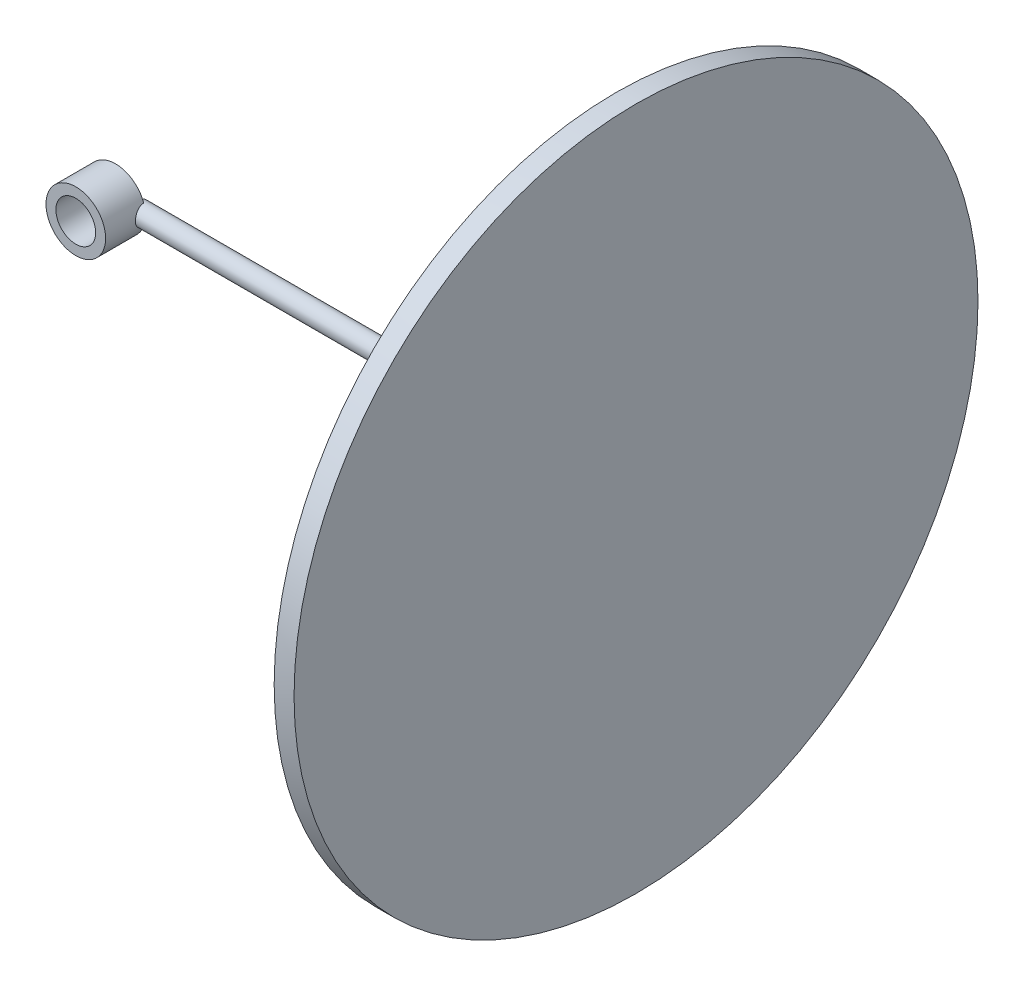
ISO-10303-21;
HEADER;
FILE_DESCRIPTION(('STEP AP214'),'2;1');
FILE_NAME('part.step','',(''),(''),'','','');
FILE_SCHEMA(('AUTOMOTIVE_DESIGN { 1 0 10303 214 1 1 1 1 }'));
ENDSEC;
DATA;
#1=APPLICATION_CONTEXT('core data for automotive mechanical design processes');
#2=APPLICATION_PROTOCOL_DEFINITION('international standard','automotive_design',2000,#1);
#3=PRODUCT_CONTEXT('',#1,'mechanical');
#4=PRODUCT('Part','Part','',(#3));
#5=PRODUCT_RELATED_PRODUCT_CATEGORY('part','',(#4));
#6=PRODUCT_DEFINITION_FORMATION('','',#4);
#7=PRODUCT_DEFINITION_CONTEXT('part definition',#1,'design');
#8=PRODUCT_DEFINITION('design','',#6,#7);
#9=PRODUCT_DEFINITION_SHAPE('','',#8);
#10=(LENGTH_UNIT() NAMED_UNIT(*) SI_UNIT(.MILLI.,.METRE.));
#11=(NAMED_UNIT(*) PLANE_ANGLE_UNIT() SI_UNIT($,.RADIAN.));
#12=(NAMED_UNIT(*) SI_UNIT($,.STERADIAN.) SOLID_ANGLE_UNIT());
#13=UNCERTAINTY_MEASURE_WITH_UNIT(LENGTH_MEASURE(1.E-05),#10,'distance_accuracy_value','');
#14=(GEOMETRIC_REPRESENTATION_CONTEXT(3) GLOBAL_UNCERTAINTY_ASSIGNED_CONTEXT((#13)) GLOBAL_UNIT_ASSIGNED_CONTEXT((#10,
#11,#12)) REPRESENTATION_CONTEXT('',''));
#15=CARTESIAN_POINT('',(0.,0.,0.));
#16=DIRECTION('',(0.,0.,1.));
#17=DIRECTION('',(1.,0.,0.));
#18=AXIS2_PLACEMENT_3D('',#15,#16,#17);
#19=CARTESIAN_POINT('',(-73.8428088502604,4.70438828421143,0.));
#20=DIRECTION('',(1.,0.,0.));
#21=DIRECTION('',(0.,1.,0.));
#22=AXIS2_PLACEMENT_3D('',#19,#20,#21);
#23=CYLINDRICAL_SURFACE('',#22,2.5);
#24=CARTESIAN_POINT('',(-88.2758739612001,4.70438828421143,0.));
#25=DIRECTION('',(1.,0.,0.));
#26=DIRECTION('',(0.,1.,0.));
#27=AXIS2_PLACEMENT_3D('',#24,#25,#26);
#28=CIRCLE('',#27,2.49999999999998);
#29=CARTESIAN_POINT('',(-88.2758739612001,7.20438828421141,0.));
#30=VERTEX_POINT('',#29);
#31=EDGE_CURVE('E90',#30,#30,#28,.T.);
#32=ORIENTED_EDGE('',*,*,#31,.F.);
#33=EDGE_LOOP('',(#32));
#34=FACE_BOUND('',#33,.T.);
#35=CARTESIAN_POINT('',(-207.08903190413,7.20438828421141,0.));
#36=CARTESIAN_POINT('',(-207.089042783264,7.20439727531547,0.0682070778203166));
#37=CARTESIAN_POINT('',(-207.08804527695,7.20159715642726,0.13640807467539));
#38=CARTESIAN_POINT('',(-207.084114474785,7.19044874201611,0.272281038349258));
#39=CARTESIAN_POINT('',(-207.081181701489,7.18210194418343,0.339953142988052));
#40=CARTESIAN_POINT('',(-207.07347266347,7.15996287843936,0.47409048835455));
#41=CARTESIAN_POINT('',(-207.068701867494,7.14618676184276,0.540558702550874));
#42=CARTESIAN_POINT('',(-207.057473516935,7.11333009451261,0.672008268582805));
#43=CARTESIAN_POINT('',(-207.051015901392,7.09424935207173,0.736989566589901));
#44=CARTESIAN_POINT('',(-207.029400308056,7.02930379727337,0.928961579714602));
#45=CARTESIAN_POINT('',(-207.011987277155,6.97570245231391,1.05317915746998));
#46=CARTESIAN_POINT('',(-206.97312937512,6.84956612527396,1.29087681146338));
#47=CARTESIAN_POINT('',(-206.951682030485,6.77701951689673,1.40435023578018));
#48=CARTESIAN_POINT('',(-206.906237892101,6.6120182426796,1.62179290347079));
#49=CARTESIAN_POINT('',(-206.882177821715,6.51895113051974,1.7252851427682));
#50=CARTESIAN_POINT('',(-206.834753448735,6.31685899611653,1.9155171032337));
#51=CARTESIAN_POINT('',(-206.81138927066,6.20783113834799,2.002253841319));
#52=CARTESIAN_POINT('',(-206.767252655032,5.97339750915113,2.15869822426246));
#53=CARTESIAN_POINT('',(-206.746563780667,5.84763853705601,2.22790230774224));
#54=CARTESIAN_POINT('',(-206.710859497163,5.58546137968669,2.3439807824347));
#55=CARTESIAN_POINT('',(-206.695842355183,5.44904646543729,2.39086199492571));
#56=CARTESIAN_POINT('',(-206.673622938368,5.17446165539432,2.45933927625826));
#57=CARTESIAN_POINT('',(-206.666166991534,5.03651787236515,2.48175817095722));
#58=CARTESIAN_POINT('',(-206.659009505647,4.75863570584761,2.50329075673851));
#59=CARTESIAN_POINT('',(-206.659306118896,4.61869780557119,2.50241000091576));
#60=CARTESIAN_POINT('',(-206.667448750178,4.34662867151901,2.4778892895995));
#61=CARTESIAN_POINT('',(-206.674998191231,4.21440652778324,2.45514340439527));
#62=CARTESIAN_POINT('',(-206.696425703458,3.9557781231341,2.3890170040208));
#63=CARTESIAN_POINT('',(-206.710304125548,3.82937218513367,2.34563534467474));
#64=CARTESIAN_POINT('',(-206.743208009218,3.58400672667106,2.23894657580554));
#65=CARTESIAN_POINT('',(-206.762298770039,3.46516702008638,2.17538488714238));
#66=CARTESIAN_POINT('',(-206.803640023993,3.23957681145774,2.03035012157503));
#67=CARTESIAN_POINT('',(-206.825891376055,3.13282960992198,1.94887217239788));
#68=CARTESIAN_POINT('',(-206.872442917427,2.92914493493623,1.76582237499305));
#69=CARTESIAN_POINT('',(-206.896790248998,2.83290425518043,1.66348614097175));
#70=CARTESIAN_POINT('',(-206.943912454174,2.65870822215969,1.44389627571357));
#71=CARTESIAN_POINT('',(-206.966686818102,2.58075877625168,1.32663784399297));
#72=CARTESIAN_POINT('',(-207.008348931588,2.44437997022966,1.07829955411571));
#73=CARTESIAN_POINT('',(-207.02717434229,2.38625576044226,0.947041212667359));
#74=CARTESIAN_POINT('',(-207.058072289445,2.29323770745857,0.675882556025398));
#75=CARTESIAN_POINT('',(-207.070155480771,2.25830719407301,0.535996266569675));
#76=CARTESIAN_POINT('',(-207.081686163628,2.22524289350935,0.328953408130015));
#77=CARTESIAN_POINT('',(-207.08443302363,2.21742563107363,0.263396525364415));
#78=CARTESIAN_POINT('',(-207.088107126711,2.20700174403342,0.131904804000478));
#79=CARTESIAN_POINT('',(-207.089036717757,2.20438839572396,0.0659705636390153));
#80=CARTESIAN_POINT('',(-207.08903190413,2.20438828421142,0.));
#81=B_SPLINE_CURVE_WITH_KNOTS('',3,(#35,#36,#37,#38,#39,#40,#41,#42,#43,#44,#45,#46,#47,#48,#49,
#50,#51,#52,#53,#54,#55,#56,#57,#58,#59,#60,#61,#62,#63,#64,#65,#66,#67,#68,#69,#70,#71,#72,#73,
#74,#75,#76,#77,#78,#79,#80),.UNSPECIFIED.,.F.,.F.,(4,2,2,2,2,2,2,2,2,2,2,2,2,2,2,2,2,2,2,2,2,2,
4),(0.,0.204546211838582,0.409037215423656,0.612924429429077,0.816819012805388,1.22401016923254,
1.63145179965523,2.0532786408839,2.47518051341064,2.90809434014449,3.34087579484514,
3.75860278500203,4.17623021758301,4.57747647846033,4.97874498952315,5.38529148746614,
5.79194868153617,6.21771736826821,6.64362337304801,7.07581676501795,7.50732520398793,
7.70536340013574,7.90314555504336),.UNSPECIFIED.);
#82=CARTESIAN_POINT('',(-207.08903190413,7.20438828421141,0.));
#83=VERTEX_POINT('',#82);
#84=CARTESIAN_POINT('',(-207.08903190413,2.20438828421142,0.));
#85=VERTEX_POINT('',#84);
#86=EDGE_CURVE('E11',#83,#85,#81,.T.);
#87=ORIENTED_EDGE('',*,*,#86,.T.);
#88=DIRECTION('',(1.,0.,0.));
#89=VECTOR('',#88,1.);
#90=CARTESIAN_POINT('',(-73.8428088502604,2.20438828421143,0.));
#91=LINE('',#90,#89);
#92=CARTESIAN_POINT('',(-208.2758739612,2.2043882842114,0.));
#93=VERTEX_POINT('',#92);
#94=EDGE_CURVE('E74',#85,#93,#91,.F.);
#95=ORIENTED_EDGE('',*,*,#94,.T.);
#96=CARTESIAN_POINT('',(-208.2758739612,4.70438828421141,0.));
#97=DIRECTION('',(1.,0.,0.));
#98=DIRECTION('',(0.,1.,0.));
#99=AXIS2_PLACEMENT_3D('',#96,#97,#98);
#100=CIRCLE('',#99,2.50000000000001);
#101=CARTESIAN_POINT('',(-208.2758739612,7.20438828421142,0.));
#102=VERTEX_POINT('',#101);
#103=EDGE_CURVE('E80',#93,#102,#100,.T.);
#104=ORIENTED_EDGE('',*,*,#103,.T.);
#105=DIRECTION('',(1.,0.,0.));
#106=VECTOR('',#105,1.);
#107=CARTESIAN_POINT('',(-73.8428088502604,7.20438828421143,0.));
#108=LINE('',#107,#106);
#109=EDGE_CURVE('E57',#102,#83,#108,.T.);
#110=ORIENTED_EDGE('',*,*,#109,.T.);
#111=EDGE_LOOP('',(#87,#95,#104,#110));
#112=FACE_BOUND('',#111,.T.);
#113=ADVANCED_FACE('F37',(#34,#112),#23,.T.);
#114=CARTESIAN_POINT('',(-208.2758739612,7.20438828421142,0.));
#115=DIRECTION('',(-1.,0.,0.));
#116=DIRECTION('',(0.,-1.,0.));
#117=AXIS2_PLACEMENT_3D('',#114,#115,#116);
#118=PLANE('',#117);
#119=ORIENTED_EDGE('',*,*,#103,.F.);
#120=DIRECTION('',(0.,1.,0.));
#121=VECTOR('',#120,1.);
#122=CARTESIAN_POINT('',(-208.2758739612,7.20438828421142,0.));
#123=LINE('',#122,#121);
#124=EDGE_CURVE('E50',#93,#102,#123,.T.);
#125=ORIENTED_EDGE('',*,*,#124,.T.);
#126=EDGE_LOOP('',(#119,#125));
#127=FACE_BOUND('',#126,.T.);
#128=ADVANCED_FACE('F96',(#127),#118,.T.);
#129=CARTESIAN_POINT('',(-85.7758739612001,4.70438828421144,0.));
#130=DIRECTION('',(1.,0.,0.));
#131=DIRECTION('',(0.,1.,0.));
#132=AXIS2_PLACEMENT_3D('',#129,#130,#131);
#133=SPHERICAL_SURFACE('',#132,86.036329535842);
#134=CARTESIAN_POINT('',(-88.2758739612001,4.70438828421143,0.));
#135=DIRECTION('',(1.,0.,0.));
#136=DIRECTION('',(0.,1.,0.));
#137=AXIS2_PLACEMENT_3D('',#134,#135,#136);
#138=CIRCLE('',#137,86.);
#139=CARTESIAN_POINT('',(-88.2758739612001,90.7043882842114,0.));
#140=VERTEX_POINT('',#139);
#141=EDGE_CURVE('E93',#140,#140,#138,.T.);
#142=CARTESIAN_POINT('',(-83.2758739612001,4.70438828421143,0.));
#143=DIRECTION('',(1.,0.,0.));
#144=DIRECTION('',(0.,1.,0.));
#145=AXIS2_PLACEMENT_3D('',#142,#143,#144);
#146=CIRCLE('',#145,86.);
#147=CARTESIAN_POINT('',(-83.2758739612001,90.7043882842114,0.));
#148=VERTEX_POINT('',#147);
#149=EDGE_CURVE('E82',#148,#148,#146,.T.);
#150=CARTESIAN_POINT('',(-88.2758739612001,90.7043882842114,0.));
#151=CARTESIAN_POINT('',(-88.223805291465,90.7059019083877,0.));
#152=CARTESIAN_POINT('',(-88.1717352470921,90.7073682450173,0.));
#153=CARTESIAN_POINT('',(-88.0675925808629,90.7102063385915,0.));
#154=CARTESIAN_POINT('',(-88.0155199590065,90.7115780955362,0.));
#155=CARTESIAN_POINT('',(-87.9113723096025,90.714227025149,0.));
#156=CARTESIAN_POINT('',(-87.8592972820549,90.7155041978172,0.));
#157=CARTESIAN_POINT('',(-87.7551449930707,90.7179639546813,0.));
#158=CARTESIAN_POINT('',(-87.7030677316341,90.7191465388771,0.));
#159=CARTESIAN_POINT('',(-87.5989111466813,90.7214171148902,0.));
#160=CARTESIAN_POINT('',(-87.546831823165,90.7225051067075,0.));
#161=CARTESIAN_POINT('',(-87.4426712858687,90.7245864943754,0.));
#162=CARTESIAN_POINT('',(-87.3905900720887,90.7255798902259,0.));
#163=CARTESIAN_POINT('',(-87.2864259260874,90.7274720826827,0.));
#164=CARTESIAN_POINT('',(-87.2343429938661,90.7283708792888,0.));
#165=CARTESIAN_POINT('',(-87.13017558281,90.7300738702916,0.));
#166=CARTESIAN_POINT('',(-87.0780911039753,90.7308780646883,0.));
#167=CARTESIAN_POINT('',(-86.9739207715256,90.7323918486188,0.));
#168=CARTESIAN_POINT('',(-86.9218349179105,90.7331014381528,0.));
#169=CARTESIAN_POINT('',(-86.8176620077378,90.7344260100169,0.));
#170=CARTESIAN_POINT('',(-86.7655749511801,90.7350409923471,0.));
#171=CARTESIAN_POINT('',(-86.6613998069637,90.7361763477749,0.));
#172=CARTESIAN_POINT('',(-86.6093117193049,90.7366967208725,0.));
#173=CARTESIAN_POINT('',(-86.5051346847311,90.7376428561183,0.));
#174=CARTESIAN_POINT('',(-86.4530457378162,90.7380686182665,0.));
#175=CARTESIAN_POINT('',(-86.3488671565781,90.7388255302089,0.));
#176=CARTESIAN_POINT('',(-86.2967775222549,90.739156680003,0.));
#177=CARTESIAN_POINT('',(-86.1925977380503,90.7397243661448,0.));
#178=CARTESIAN_POINT('',(-86.1405075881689,90.7399609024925,0.));
#179=CARTESIAN_POINT('',(-86.0363269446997,90.7403393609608,0.));
#180=CARTESIAN_POINT('',(-85.9842364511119,90.7404812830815,0.));
#181=CARTESIAN_POINT('',(-85.8800552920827,90.7406705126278,0.));
#182=CARTESIAN_POINT('',(-85.8279646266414,90.7407178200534,0.));
#183=CARTESIAN_POINT('',(-85.7237832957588,90.7407178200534,0.));
#184=CARTESIAN_POINT('',(-85.6716926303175,90.7406705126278,0.));
#185=CARTESIAN_POINT('',(-85.5675114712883,90.7404812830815,0.));
#186=CARTESIAN_POINT('',(-85.5154209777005,90.7403393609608,0.));
#187=CARTESIAN_POINT('',(-85.4112403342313,90.7399609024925,0.));
#188=CARTESIAN_POINT('',(-85.3591501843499,90.7397243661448,0.));
#189=CARTESIAN_POINT('',(-85.2549704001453,90.739156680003,0.));
#190=CARTESIAN_POINT('',(-85.2028807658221,90.7388255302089,0.));
#191=CARTESIAN_POINT('',(-85.098702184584,90.7380686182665,0.));
#192=CARTESIAN_POINT('',(-85.0466132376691,90.7376428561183,0.));
#193=CARTESIAN_POINT('',(-84.9424362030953,90.7366967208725,0.));
#194=CARTESIAN_POINT('',(-84.8903481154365,90.7361763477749,0.));
#195=CARTESIAN_POINT('',(-84.7861729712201,90.7350409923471,0.));
#196=CARTESIAN_POINT('',(-84.7340859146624,90.7344260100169,0.));
#197=CARTESIAN_POINT('',(-84.6299130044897,90.7331014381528,0.));
#198=CARTESIAN_POINT('',(-84.5778271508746,90.7323918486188,0.));
#199=CARTESIAN_POINT('',(-84.4736568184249,90.7308780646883,0.));
#200=CARTESIAN_POINT('',(-84.4215723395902,90.7300738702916,0.));
#201=CARTESIAN_POINT('',(-84.3174049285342,90.7283708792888,0.));
#202=CARTESIAN_POINT('',(-84.2653219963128,90.7274720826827,0.));
#203=CARTESIAN_POINT('',(-84.1611578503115,90.7255798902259,0.));
#204=CARTESIAN_POINT('',(-84.1090766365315,90.7245864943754,0.));
#205=CARTESIAN_POINT('',(-84.0049160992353,90.7225051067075,0.));
#206=CARTESIAN_POINT('',(-83.9528367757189,90.7214171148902,0.));
#207=CARTESIAN_POINT('',(-83.8486801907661,90.7191465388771,0.));
#208=CARTESIAN_POINT('',(-83.7966029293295,90.7179639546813,0.));
#209=CARTESIAN_POINT('',(-83.6924506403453,90.7155041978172,0.));
#210=CARTESIAN_POINT('',(-83.6403756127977,90.714227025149,0.));
#211=CARTESIAN_POINT('',(-83.5362279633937,90.7115780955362,0.));
#212=CARTESIAN_POINT('',(-83.4841553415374,90.7102063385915,0.));
#213=CARTESIAN_POINT('',(-83.3800126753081,90.7073682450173,0.));
#214=CARTESIAN_POINT('',(-83.3279426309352,90.7059019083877,0.));
#215=CARTESIAN_POINT('',(-83.2758739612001,90.7043882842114,0.));
#216=B_SPLINE_CURVE_WITH_KNOTS('',3,(#150,#151,#152,#153,#154,#155,#156,#157,#158,#159,#160,
#161,#162,#163,#164,#165,#166,#167,#168,#169,#170,#171,#172,#173,#174,#175,#176,#177,#178,#179,
#180,#181,#182,#183,#184,#185,#186,#187,#188,#189,#190,#191,#192,#193,#194,#195,#196,#197,#198,
#199,#200,#201,#202,#203,#204,#205,#206,#207,#208,#209,#210,#211,#212,#213,#214,#215),
.UNSPECIFIED.,.F.,.F.,(4,2,2,2,2,2,2,2,2,2,2,2,2,2,2,2,2,2,2,2,2,2,2,2,2,2,2,2,2,2,2,2,4),(0.,
0.156271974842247,0.312543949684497,0.468815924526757,0.625087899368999,0.781359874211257,
0.937631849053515,1.09390382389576,1.25017579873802,1.40644777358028,1.56271974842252,
1.71899172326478,1.87526369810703,2.03153567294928,2.18780764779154,2.34407962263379,
2.50035159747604,2.6566235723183,2.81289554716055,2.9691675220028,3.12543949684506,
3.28171147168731,3.43798344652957,3.59425542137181,3.75052739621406,3.90679937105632,
4.06307134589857,4.21934332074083,4.37561529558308,4.53188727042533,4.68815924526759,
4.84443122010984,5.00070319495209),.UNSPECIFIED.);
#217=EDGE_CURVE('BSEAM39',#140,#148,#216,.T.);
#218=ORIENTED_EDGE('',*,*,#141,.T.);
#219=ORIENTED_EDGE('',*,*,#149,.F.);
#220=ORIENTED_EDGE('',*,*,#217,.T.);
#221=ORIENTED_EDGE('',*,*,#217,.F.);
#222=EDGE_LOOP('',(#218,#220,#219,#221));
#223=FACE_BOUND('',#222,.T.);
#224=ADVANCED_FACE('F39',(#223),#133,.T.);
#225=CARTESIAN_POINT('',(-88.2758739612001,90.7043882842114,0.));
#226=DIRECTION('',(-1.,0.,0.));
#227=DIRECTION('',(0.,-1.,0.));
#228=AXIS2_PLACEMENT_3D('',#225,#226,#227);
#229=PLANE('',#228);
#230=ORIENTED_EDGE('',*,*,#31,.T.);
#231=EDGE_LOOP('',(#230));
#232=FACE_BOUND('',#231,.T.);
#233=ORIENTED_EDGE('',*,*,#141,.F.);
#234=EDGE_LOOP('',(#233));
#235=FACE_BOUND('',#234,.T.);
#236=ADVANCED_FACE('F103',(#232,#235),#229,.T.);
#237=CARTESIAN_POINT('',(-83.2758739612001,90.7043882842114,0.));
#238=DIRECTION('',(1.,0.,0.));
#239=DIRECTION('',(0.,1.,0.));
#240=AXIS2_PLACEMENT_3D('',#237,#238,#239);
#241=PLANE('',#240);
#242=ORIENTED_EDGE('',*,*,#149,.T.);
#243=EDGE_LOOP('',(#242));
#244=FACE_BOUND('',#243,.T.);
#245=ADVANCED_FACE('F107',(#244),#241,.T.);
#246=CARTESIAN_POINT('',(-214.160099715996,4.70438828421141,10.));
#247=DIRECTION('',(0.,0.,1.));
#248=DIRECTION('',(1.,0.,0.));
#249=AXIS2_PLACEMENT_3D('',#246,#247,#248);
#250=PLANE('',#249);
#251=CARTESIAN_POINT('',(-214.160099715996,4.70438828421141,10.));
#252=DIRECTION('',(0.,0.,1.));
#253=DIRECTION('',(1.,0.,0.));
#254=AXIS2_PLACEMENT_3D('',#251,#252,#253);
#255=CIRCLE('',#254,7.50000000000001);
#256=CARTESIAN_POINT('',(-206.660099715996,4.70438828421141,10.));
#257=VERTEX_POINT('',#256);
#258=EDGE_CURVE('E75',#257,#257,#255,.T.);
#259=ORIENTED_EDGE('',*,*,#258,.T.);
#260=EDGE_LOOP('',(#259));
#261=FACE_BOUND('',#260,.T.);
#262=CARTESIAN_POINT('',(-214.160099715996,4.70438828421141,10.));
#263=DIRECTION('',(0.,0.,1.));
#264=DIRECTION('',(1.,0.,0.));
#265=AXIS2_PLACEMENT_3D('',#262,#263,#264);
#266=CIRCLE('',#265,4.99999999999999);
#267=CARTESIAN_POINT('',(-209.160099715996,4.70438828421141,10.));
#268=VERTEX_POINT('',#267);
#269=EDGE_CURVE('E76',#268,#268,#266,.T.);
#270=ORIENTED_EDGE('',*,*,#269,.F.);
#271=EDGE_LOOP('',(#270));
#272=FACE_BOUND('',#271,.T.);
#273=ADVANCED_FACE('F114',(#261,#272),#250,.T.);
#274=CARTESIAN_POINT('',(-214.160099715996,4.70438828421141,0.));
#275=DIRECTION('',(0.,0.,1.));
#276=DIRECTION('',(1.,0.,0.));
#277=AXIS2_PLACEMENT_3D('',#274,#275,#276);
#278=PLANE('',#277);
#279=ORIENTED_EDGE('',*,*,#94,.F.);
#280=CARTESIAN_POINT('',(-214.160099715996,4.70438828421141,0.));
#281=DIRECTION('',(0.,0.,1.));
#282=DIRECTION('',(1.,0.,0.));
#283=AXIS2_PLACEMENT_3D('',#280,#281,#282);
#284=CIRCLE('',#283,7.50000000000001);
#285=EDGE_CURVE('E70',#83,#85,#284,.T.);
#286=ORIENTED_EDGE('',*,*,#285,.F.);
#287=ORIENTED_EDGE('',*,*,#109,.F.);
#288=ORIENTED_EDGE('',*,*,#124,.F.);
#289=EDGE_LOOP('',(#279,#286,#287,#288));
#290=FACE_BOUND('',#289,.T.);
#291=CARTESIAN_POINT('',(-214.160099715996,4.70438828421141,0.));
#292=DIRECTION('',(0.,0.,1.));
#293=DIRECTION('',(1.,0.,0.));
#294=AXIS2_PLACEMENT_3D('',#291,#292,#293);
#295=CIRCLE('',#294,4.99999999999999);
#296=CARTESIAN_POINT('',(-209.160099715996,4.70438828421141,0.));
#297=VERTEX_POINT('',#296);
#298=EDGE_CURVE('E146',#297,#297,#295,.T.);
#299=ORIENTED_EDGE('',*,*,#298,.T.);
#300=EDGE_LOOP('',(#299));
#301=FACE_BOUND('',#300,.T.);
#302=ADVANCED_FACE('F72',(#290,#301),#278,.F.);
#303=CARTESIAN_POINT('',(-214.160099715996,4.70438828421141,10.));
#304=DIRECTION('',(0.,0.,-1.));
#305=DIRECTION('',(-1.,0.,0.));
#306=AXIS2_PLACEMENT_3D('',#303,#304,#305);
#307=CYLINDRICAL_SURFACE('',#306,7.50000000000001);
#308=ORIENTED_EDGE('',*,*,#86,.F.);
#309=ORIENTED_EDGE('',*,*,#285,.T.);
#310=EDGE_LOOP('',(#308,#309));
#311=FACE_BOUND('',#310,.T.);
#312=ORIENTED_EDGE('',*,*,#258,.F.);
#313=EDGE_LOOP('',(#312));
#314=FACE_BOUND('',#313,.T.);
#315=ADVANCED_FACE('F68',(#311,#314),#307,.T.);
#316=CARTESIAN_POINT('',(-214.160099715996,4.70438828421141,10.));
#317=DIRECTION('',(0.,0.,-1.));
#318=DIRECTION('',(-1.,0.,0.));
#319=AXIS2_PLACEMENT_3D('',#316,#317,#318);
#320=CYLINDRICAL_SURFACE('',#319,4.99999999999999);
#321=ORIENTED_EDGE('',*,*,#269,.T.);
#322=EDGE_LOOP('',(#321));
#323=FACE_BOUND('',#322,.T.);
#324=ORIENTED_EDGE('',*,*,#298,.F.);
#325=EDGE_LOOP('',(#324));
#326=FACE_BOUND('',#325,.T.);
#327=ADVANCED_FACE('F134',(#323,#326),#320,.F.);
#328=CLOSED_SHELL('',(#113,#128,#224,#236,#245,#273,#302,#315,#327));
#329=MANIFOLD_SOLID_BREP('B2',#328);
#330=ADVANCED_BREP_SHAPE_REPRESENTATION('',(#18,#329),#14);
#331=SHAPE_DEFINITION_REPRESENTATION(#9,#330);
ENDSEC;
END-ISO-10303-21;
